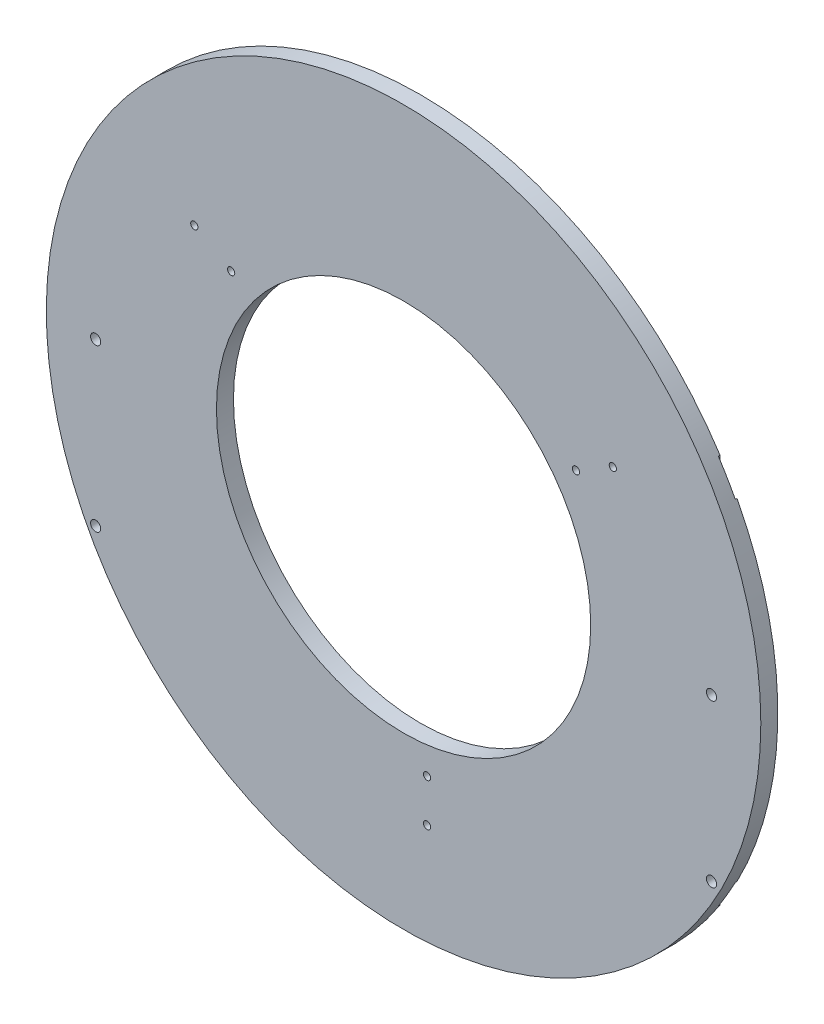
ISO-10303-21;
HEADER;
FILE_DESCRIPTION(('STEP AP214'),'2;1');
FILE_NAME('part.step','',(''),(''),'','','');
FILE_SCHEMA(('AUTOMOTIVE_DESIGN { 1 0 10303 214 1 1 1 1 }'));
ENDSEC;
DATA;
#1=APPLICATION_CONTEXT('core data for automotive mechanical design processes');
#2=APPLICATION_PROTOCOL_DEFINITION('international standard','automotive_design',2000,#1);
#3=PRODUCT_CONTEXT('',#1,'mechanical');
#4=PRODUCT('Part','Part','',(#3));
#5=PRODUCT_RELATED_PRODUCT_CATEGORY('part','',(#4));
#6=PRODUCT_DEFINITION_FORMATION('','',#4);
#7=PRODUCT_DEFINITION_CONTEXT('part definition',#1,'design');
#8=PRODUCT_DEFINITION('design','',#6,#7);
#9=PRODUCT_DEFINITION_SHAPE('','',#8);
#10=(LENGTH_UNIT() NAMED_UNIT(*) SI_UNIT(.MILLI.,.METRE.));
#11=(NAMED_UNIT(*) PLANE_ANGLE_UNIT() SI_UNIT($,.RADIAN.));
#12=(NAMED_UNIT(*) SI_UNIT($,.STERADIAN.) SOLID_ANGLE_UNIT());
#13=UNCERTAINTY_MEASURE_WITH_UNIT(LENGTH_MEASURE(1.E-05),#10,'distance_accuracy_value','');
#14=(GEOMETRIC_REPRESENTATION_CONTEXT(3) GLOBAL_UNCERTAINTY_ASSIGNED_CONTEXT((#13)) GLOBAL_UNIT_ASSIGNED_CONTEXT((#10,
#11,#12)) REPRESENTATION_CONTEXT('',''));
#15=CARTESIAN_POINT('',(0.,0.,0.));
#16=DIRECTION('',(0.,0.,1.));
#17=DIRECTION('',(1.,0.,0.));
#18=AXIS2_PLACEMENT_3D('',#15,#16,#17);
#19=CARTESIAN_POINT('',(0.,0.,0.));
#20=DIRECTION('',(0.,0.,1.));
#21=DIRECTION('',(1.,0.,0.));
#22=AXIS2_PLACEMENT_3D('',#19,#20,#21);
#23=PLANE('',#22);
#24=CARTESIAN_POINT('',(0.,0.,0.));
#25=DIRECTION('',(0.,0.,1.));
#26=DIRECTION('',(1.,0.,0.));
#27=AXIS2_PLACEMENT_3D('',#24,#25,#26);
#28=CIRCLE('',#27,133.35);
#29=CARTESIAN_POINT('',(-118.11,61.9051726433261,0.));
#30=VERTEX_POINT('',#29);
#31=CARTESIAN_POINT('',(-118.11,-61.9051726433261,0.));
#32=VERTEX_POINT('',#31);
#33=EDGE_CURVE('E232',#30,#32,#28,.T.);
#34=ORIENTED_EDGE('',*,*,#33,.F.);
#35=DIRECTION('',(0.,1.,0.));
#36=VECTOR('',#35,1.);
#37=CARTESIAN_POINT('',(-118.11,72.745617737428,0.));
#38=LINE('',#37,#36);
#39=EDGE_CURVE('E117',#32,#30,#38,.T.);
#40=ORIENTED_EDGE('',*,*,#39,.F.);
#41=EDGE_LOOP('',(#34,#40));
#42=FACE_BOUND('',#41,.T.);
#43=ADVANCED_FACE('F35',(#42),#23,.F.);
#44=CARTESIAN_POINT('',(-114.935,-60.325,6.35));
#45=DIRECTION('',(0.,0.,1.));
#46=DIRECTION('',(1.,0.,0.));
#47=AXIS2_PLACEMENT_3D('',#44,#45,#46);
#48=CYLINDRICAL_SURFACE('',#47,1.89864999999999);
#49=CARTESIAN_POINT('',(-114.935,-60.325,6.35));
#50=DIRECTION('',(0.,0.,1.));
#51=DIRECTION('',(1.,0.,0.));
#52=AXIS2_PLACEMENT_3D('',#49,#50,#51);
#53=CIRCLE('',#52,1.89864999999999);
#54=CARTESIAN_POINT('',(-113.03635,-60.325,6.35));
#55=VERTEX_POINT('',#54);
#56=EDGE_CURVE('E158',#55,#55,#53,.T.);
#57=ORIENTED_EDGE('',*,*,#56,.T.);
#58=EDGE_LOOP('',(#57));
#59=FACE_BOUND('',#58,.T.);
#60=CARTESIAN_POINT('',(-114.935,-60.325,0.635));
#61=DIRECTION('',(0.,0.,-1.));
#62=DIRECTION('',(-1.,0.,0.));
#63=AXIS2_PLACEMENT_3D('',#60,#61,#62);
#64=CIRCLE('',#63,1.89864999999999);
#65=CARTESIAN_POINT('',(-116.83365,-60.325,0.635));
#66=VERTEX_POINT('',#65);
#67=EDGE_CURVE('E130',#66,#66,#64,.F.);
#68=ORIENTED_EDGE('',*,*,#67,.F.);
#69=EDGE_LOOP('',(#68));
#70=FACE_BOUND('',#69,.T.);
#71=ADVANCED_FACE('F264',(#59,#70),#48,.F.);
#72=CARTESIAN_POINT('',(-114.935,0.,6.35));
#73=DIRECTION('',(0.,0.,1.));
#74=DIRECTION('',(1.,0.,0.));
#75=AXIS2_PLACEMENT_3D('',#72,#73,#74);
#76=CYLINDRICAL_SURFACE('',#75,1.89864999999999);
#77=CARTESIAN_POINT('',(-114.935,0.,6.35));
#78=DIRECTION('',(0.,0.,1.));
#79=DIRECTION('',(1.,0.,0.));
#80=AXIS2_PLACEMENT_3D('',#77,#78,#79);
#81=CIRCLE('',#80,1.89864999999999);
#82=CARTESIAN_POINT('',(-113.03635,0.,6.35));
#83=VERTEX_POINT('',#82);
#84=EDGE_CURVE('E152',#83,#83,#81,.T.);
#85=ORIENTED_EDGE('',*,*,#84,.T.);
#86=EDGE_LOOP('',(#85));
#87=FACE_BOUND('',#86,.T.);
#88=CARTESIAN_POINT('',(-114.935,0.,0.635));
#89=DIRECTION('',(0.,0.,-1.));
#90=DIRECTION('',(-1.,0.,0.));
#91=AXIS2_PLACEMENT_3D('',#88,#89,#90);
#92=CIRCLE('',#91,1.89864999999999);
#93=CARTESIAN_POINT('',(-116.83365,0.,0.635));
#94=VERTEX_POINT('',#93);
#95=EDGE_CURVE('E125',#94,#94,#92,.F.);
#96=ORIENTED_EDGE('',*,*,#95,.F.);
#97=EDGE_LOOP('',(#96));
#98=FACE_BOUND('',#97,.T.);
#99=ADVANCED_FACE('F268',(#87,#98),#76,.F.);
#100=CARTESIAN_POINT('',(118.11,-61.9051726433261,0.));
#101=VERTEX_POINT('',#100);
#102=CARTESIAN_POINT('',(118.11,61.9051726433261,0.));
#103=VERTEX_POINT('',#102);
#104=EDGE_CURVE('E168',#101,#103,#28,.T.);
#105=ORIENTED_EDGE('',*,*,#104,.F.);
#106=DIRECTION('',(0.,-1.,0.));
#107=VECTOR('',#106,1.);
#108=CARTESIAN_POINT('',(118.11,72.745617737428,0.));
#109=LINE('',#108,#107);
#110=EDGE_CURVE('E107',#103,#101,#109,.T.);
#111=ORIENTED_EDGE('',*,*,#110,.F.);
#112=EDGE_LOOP('',(#105,#111));
#113=FACE_BOUND('',#112,.T.);
#114=ADVANCED_FACE('F246',(#113),#23,.F.);
#115=CARTESIAN_POINT('',(114.935,-60.325,6.35));
#116=DIRECTION('',(0.,0.,1.));
#117=DIRECTION('',(1.,0.,0.));
#118=AXIS2_PLACEMENT_3D('',#115,#116,#117);
#119=CYLINDRICAL_SURFACE('',#118,1.89864999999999);
#120=CARTESIAN_POINT('',(114.935,-60.325,6.35));
#121=DIRECTION('',(0.,0.,1.));
#122=DIRECTION('',(1.,0.,0.));
#123=AXIS2_PLACEMENT_3D('',#120,#121,#122);
#124=CIRCLE('',#123,1.89864999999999);
#125=CARTESIAN_POINT('',(116.83365,-60.325,6.35));
#126=VERTEX_POINT('',#125);
#127=EDGE_CURVE('E161',#126,#126,#124,.T.);
#128=ORIENTED_EDGE('',*,*,#127,.T.);
#129=EDGE_LOOP('',(#128));
#130=FACE_BOUND('',#129,.T.);
#131=CARTESIAN_POINT('',(114.935,-60.325,0.635));
#132=DIRECTION('',(0.,0.,-1.));
#133=DIRECTION('',(-1.,0.,0.));
#134=AXIS2_PLACEMENT_3D('',#131,#132,#133);
#135=CIRCLE('',#134,1.89864999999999);
#136=CARTESIAN_POINT('',(113.03635,-60.325,0.635));
#137=VERTEX_POINT('',#136);
#138=EDGE_CURVE('E146',#137,#137,#135,.F.);
#139=ORIENTED_EDGE('',*,*,#138,.F.);
#140=EDGE_LOOP('',(#139));
#141=FACE_BOUND('',#140,.T.);
#142=ADVANCED_FACE('F272',(#130,#141),#119,.F.);
#143=CARTESIAN_POINT('',(114.935,0.,6.35));
#144=DIRECTION('',(0.,0.,1.));
#145=DIRECTION('',(1.,0.,0.));
#146=AXIS2_PLACEMENT_3D('',#143,#144,#145);
#147=CYLINDRICAL_SURFACE('',#146,1.89864999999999);
#148=CARTESIAN_POINT('',(114.935,0.,6.35));
#149=DIRECTION('',(0.,0.,1.));
#150=DIRECTION('',(1.,0.,0.));
#151=AXIS2_PLACEMENT_3D('',#148,#149,#150);
#152=CIRCLE('',#151,1.89864999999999);
#153=CARTESIAN_POINT('',(116.83365,0.,6.35));
#154=VERTEX_POINT('',#153);
#155=EDGE_CURVE('E155',#154,#154,#152,.T.);
#156=ORIENTED_EDGE('',*,*,#155,.T.);
#157=EDGE_LOOP('',(#156));
#158=FACE_BOUND('',#157,.T.);
#159=CARTESIAN_POINT('',(114.935,0.,0.635));
#160=DIRECTION('',(0.,0.,-1.));
#161=DIRECTION('',(-1.,0.,0.));
#162=AXIS2_PLACEMENT_3D('',#159,#160,#161);
#163=CIRCLE('',#162,1.89864999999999);
#164=CARTESIAN_POINT('',(113.03635,0.,0.635));
#165=VERTEX_POINT('',#164);
#166=EDGE_CURVE('E143',#165,#165,#163,.F.);
#167=ORIENTED_EDGE('',*,*,#166,.F.);
#168=EDGE_LOOP('',(#167));
#169=FACE_BOUND('',#168,.T.);
#170=ADVANCED_FACE('F278',(#158,#169),#147,.F.);
#171=CARTESIAN_POINT('',(0.,0.,6.35));
#172=DIRECTION('',(0.,0.,1.));
#173=DIRECTION('',(1.,0.,0.));
#174=AXIS2_PLACEMENT_3D('',#171,#172,#173);
#175=PLANE('',#174);
#176=CARTESIAN_POINT('',(8.763,-79.375,6.35));
#177=DIRECTION('',(0.,0.,1.));
#178=DIRECTION('',(1.,0.,0.));
#179=AXIS2_PLACEMENT_3D('',#176,#177,#178);
#180=CIRCLE('',#179,1.35254999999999);
#181=CARTESIAN_POINT('',(10.11555,-79.375,6.35));
#182=VERTEX_POINT('',#181);
#183=EDGE_CURVE('E217',#182,#182,#180,.T.);
#184=ORIENTED_EDGE('',*,*,#183,.F.);
#185=EDGE_LOOP('',(#184));
#186=FACE_BOUND('',#185,.T.);
#187=CARTESIAN_POINT('',(8.76300000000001,-95.25,6.35));
#188=DIRECTION('',(0.,0.,1.));
#189=DIRECTION('',(1.,0.,0.));
#190=AXIS2_PLACEMENT_3D('',#187,#188,#189);
#191=CIRCLE('',#190,1.35254999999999);
#192=CARTESIAN_POINT('',(10.11555,-95.25,6.35));
#193=VERTEX_POINT('',#192);
#194=EDGE_CURVE('E207',#193,#193,#191,.T.);
#195=ORIENTED_EDGE('',*,*,#194,.F.);
#196=EDGE_LOOP('',(#195));
#197=FACE_BOUND('',#196,.T.);
#198=CARTESIAN_POINT('',(64.3592664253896,47.2764806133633,6.35));
#199=DIRECTION('',(0.,0.,1.));
#200=DIRECTION('',(1.,0.,0.));
#201=AXIS2_PLACEMENT_3D('',#198,#199,#200);
#202=CIRCLE('',#201,1.35254999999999);
#203=CARTESIAN_POINT('',(65.7118164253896,47.2764806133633,6.35));
#204=VERTEX_POINT('',#203);
#205=EDGE_CURVE('E204',#204,#204,#202,.T.);
#206=ORIENTED_EDGE('',*,*,#205,.F.);
#207=EDGE_LOOP('',(#206));
#208=FACE_BOUND('',#207,.T.);
#209=CARTESIAN_POINT('',(78.1074197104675,55.2139806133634,6.35));
#210=DIRECTION('',(0.,0.,1.));
#211=DIRECTION('',(1.,0.,0.));
#212=AXIS2_PLACEMENT_3D('',#209,#210,#211);
#213=CIRCLE('',#212,1.35254999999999);
#214=CARTESIAN_POINT('',(79.4599697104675,55.2139806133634,6.35));
#215=VERTEX_POINT('',#214);
#216=EDGE_CURVE('E201',#215,#215,#213,.T.);
#217=ORIENTED_EDGE('',*,*,#216,.F.);
#218=EDGE_LOOP('',(#217));
#219=FACE_BOUND('',#218,.T.);
#220=CARTESIAN_POINT('',(-78.1074197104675,55.2139806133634,6.35));
#221=DIRECTION('',(0.,0.,1.));
#222=DIRECTION('',(1.,0.,0.));
#223=AXIS2_PLACEMENT_3D('',#220,#221,#222);
#224=CIRCLE('',#223,1.35254999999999);
#225=CARTESIAN_POINT('',(-76.7548697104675,55.2139806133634,6.35));
#226=VERTEX_POINT('',#225);
#227=EDGE_CURVE('E197',#226,#226,#224,.T.);
#228=ORIENTED_EDGE('',*,*,#227,.F.);
#229=EDGE_LOOP('',(#228));
#230=FACE_BOUND('',#229,.T.);
#231=CARTESIAN_POINT('',(-64.3592664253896,47.2764806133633,6.35));
#232=DIRECTION('',(0.,0.,1.));
#233=DIRECTION('',(1.,0.,0.));
#234=AXIS2_PLACEMENT_3D('',#231,#232,#233);
#235=CIRCLE('',#234,1.35254999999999);
#236=CARTESIAN_POINT('',(-63.0067164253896,47.2764806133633,6.35));
#237=VERTEX_POINT('',#236);
#238=EDGE_CURVE('E193',#237,#237,#235,.T.);
#239=ORIENTED_EDGE('',*,*,#238,.F.);
#240=EDGE_LOOP('',(#239));
#241=FACE_BOUND('',#240,.T.);
#242=ORIENTED_EDGE('',*,*,#84,.F.);
#243=EDGE_LOOP('',(#242));
#244=FACE_BOUND('',#243,.T.);
#245=ORIENTED_EDGE('',*,*,#155,.F.);
#246=EDGE_LOOP('',(#245));
#247=FACE_BOUND('',#246,.T.);
#248=ORIENTED_EDGE('',*,*,#56,.F.);
#249=EDGE_LOOP('',(#248));
#250=FACE_BOUND('',#249,.T.);
#251=ORIENTED_EDGE('',*,*,#127,.F.);
#252=EDGE_LOOP('',(#251));
#253=FACE_BOUND('',#252,.T.);
#254=CARTESIAN_POINT('',(0.,0.,6.35));
#255=DIRECTION('',(0.,0.,1.));
#256=DIRECTION('',(1.,0.,0.));
#257=AXIS2_PLACEMENT_3D('',#254,#255,#256);
#258=CIRCLE('',#257,133.35);
#259=CARTESIAN_POINT('',(133.35,0.,6.35));
#260=VERTEX_POINT('',#259);
#261=EDGE_CURVE('E171',#260,#260,#258,.T.);
#262=ORIENTED_EDGE('',*,*,#261,.T.);
#263=EDGE_LOOP('',(#262));
#264=FACE_BOUND('',#263,.T.);
#265=CARTESIAN_POINT('',(0.,0.,6.35));
#266=DIRECTION('',(0.,0.,1.));
#267=DIRECTION('',(1.,0.,0.));
#268=AXIS2_PLACEMENT_3D('',#265,#266,#267);
#269=CIRCLE('',#268,69.85);
#270=CARTESIAN_POINT('',(69.85,0.,6.35));
#271=VERTEX_POINT('',#270);
#272=EDGE_CURVE('E165',#271,#271,#269,.T.);
#273=ORIENTED_EDGE('',*,*,#272,.F.);
#274=EDGE_LOOP('',(#273));
#275=FACE_BOUND('',#274,.T.);
#276=ADVANCED_FACE('F244',(#186,#197,#208,#219,#230,#241,#244,#247,#250,#253,#264,#275),#175,.T.);
#277=CARTESIAN_POINT('',(8.763,-79.375,0.));
#278=DIRECTION('',(0.,0.,1.));
#279=DIRECTION('',(1.,0.,0.));
#280=AXIS2_PLACEMENT_3D('',#277,#278,#279);
#281=CIRCLE('',#280,1.35254999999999);
#282=CARTESIAN_POINT('',(10.11555,-79.375,0.));
#283=VERTEX_POINT('',#282);
#284=EDGE_CURVE('E39',#283,#283,#281,.T.);
#285=ORIENTED_EDGE('',*,*,#284,.T.);
#286=EDGE_LOOP('',(#285));
#287=FACE_BOUND('',#286,.T.);
#288=CARTESIAN_POINT('',(8.76300000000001,-95.25,0.));
#289=DIRECTION('',(0.,0.,1.));
#290=DIRECTION('',(1.,0.,0.));
#291=AXIS2_PLACEMENT_3D('',#288,#289,#290);
#292=CIRCLE('',#291,1.35254999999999);
#293=CARTESIAN_POINT('',(10.11555,-95.25,0.));
#294=VERTEX_POINT('',#293);
#295=EDGE_CURVE('E205',#294,#294,#292,.T.);
#296=ORIENTED_EDGE('',*,*,#295,.T.);
#297=EDGE_LOOP('',(#296));
#298=FACE_BOUND('',#297,.T.);
#299=CARTESIAN_POINT('',(64.3592664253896,47.2764806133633,0.));
#300=DIRECTION('',(0.,0.,1.));
#301=DIRECTION('',(1.,0.,0.));
#302=AXIS2_PLACEMENT_3D('',#299,#300,#301);
#303=CIRCLE('',#302,1.35254999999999);
#304=CARTESIAN_POINT('',(65.7118164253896,47.2764806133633,0.));
#305=VERTEX_POINT('',#304);
#306=EDGE_CURVE('E202',#305,#305,#303,.T.);
#307=ORIENTED_EDGE('',*,*,#306,.T.);
#308=EDGE_LOOP('',(#307));
#309=FACE_BOUND('',#308,.T.);
#310=CARTESIAN_POINT('',(78.1074197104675,55.2139806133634,0.));
#311=DIRECTION('',(0.,0.,1.));
#312=DIRECTION('',(1.,0.,0.));
#313=AXIS2_PLACEMENT_3D('',#310,#311,#312);
#314=CIRCLE('',#313,1.35254999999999);
#315=CARTESIAN_POINT('',(79.4599697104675,55.2139806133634,0.));
#316=VERTEX_POINT('',#315);
#317=EDGE_CURVE('E198',#316,#316,#314,.T.);
#318=ORIENTED_EDGE('',*,*,#317,.T.);
#319=EDGE_LOOP('',(#318));
#320=FACE_BOUND('',#319,.T.);
#321=CARTESIAN_POINT('',(-78.1074197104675,55.2139806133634,0.));
#322=DIRECTION('',(0.,0.,1.));
#323=DIRECTION('',(1.,0.,0.));
#324=AXIS2_PLACEMENT_3D('',#321,#322,#323);
#325=CIRCLE('',#324,1.35254999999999);
#326=CARTESIAN_POINT('',(-76.7548697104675,55.2139806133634,0.));
#327=VERTEX_POINT('',#326);
#328=EDGE_CURVE('E194',#327,#327,#325,.T.);
#329=ORIENTED_EDGE('',*,*,#328,.T.);
#330=EDGE_LOOP('',(#329));
#331=FACE_BOUND('',#330,.T.);
#332=CARTESIAN_POINT('',(-64.3592664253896,47.2764806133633,0.));
#333=DIRECTION('',(0.,0.,1.));
#334=DIRECTION('',(1.,0.,0.));
#335=AXIS2_PLACEMENT_3D('',#332,#333,#334);
#336=CIRCLE('',#335,1.35254999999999);
#337=CARTESIAN_POINT('',(-63.0067164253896,47.2764806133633,0.));
#338=VERTEX_POINT('',#337);
#339=EDGE_CURVE('E189',#338,#338,#336,.T.);
#340=ORIENTED_EDGE('',*,*,#339,.T.);
#341=EDGE_LOOP('',(#340));
#342=FACE_BOUND('',#341,.T.);
#343=CARTESIAN_POINT('',(-111.76,-72.745617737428,0.));
#344=VERTEX_POINT('',#343);
#345=CARTESIAN_POINT('',(111.76,-72.745617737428,0.));
#346=VERTEX_POINT('',#345);
#347=EDGE_CURVE('E177',#344,#346,#28,.T.);
#348=ORIENTED_EDGE('',*,*,#347,.F.);
#349=DIRECTION('',(0.,-1.,0.));
#350=VECTOR('',#349,1.);
#351=CARTESIAN_POINT('',(-111.76,72.745617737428,0.));
#352=LINE('',#351,#350);
#353=CARTESIAN_POINT('',(-111.76,72.745617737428,0.));
#354=VERTEX_POINT('',#353);
#355=EDGE_CURVE('E192',#354,#344,#352,.T.);
#356=ORIENTED_EDGE('',*,*,#355,.F.);
#357=CARTESIAN_POINT('',(111.76,72.745617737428,0.));
#358=VERTEX_POINT('',#357);
#359=EDGE_CURVE('E123',#358,#354,#28,.T.);
#360=ORIENTED_EDGE('',*,*,#359,.F.);
#361=DIRECTION('',(0.,1.,0.));
#362=VECTOR('',#361,1.);
#363=CARTESIAN_POINT('',(111.76,72.745617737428,0.));
#364=LINE('',#363,#362);
#365=EDGE_CURVE('E135',#346,#358,#364,.T.);
#366=ORIENTED_EDGE('',*,*,#365,.F.);
#367=EDGE_LOOP('',(#348,#356,#360,#366));
#368=FACE_BOUND('',#367,.T.);
#369=CARTESIAN_POINT('',(0.,0.,0.));
#370=DIRECTION('',(0.,0.,1.));
#371=DIRECTION('',(1.,0.,0.));
#372=AXIS2_PLACEMENT_3D('',#369,#370,#371);
#373=CIRCLE('',#372,69.85);
#374=CARTESIAN_POINT('',(69.85,0.,0.));
#375=VERTEX_POINT('',#374);
#376=EDGE_CURVE('E164',#375,#375,#373,.T.);
#377=ORIENTED_EDGE('',*,*,#376,.T.);
#378=EDGE_LOOP('',(#377));
#379=FACE_BOUND('',#378,.T.);
#380=ADVANCED_FACE('F241',(#287,#298,#309,#320,#331,#342,#368,#379),#23,.F.);
#381=CARTESIAN_POINT('',(0.,0.,6.35));
#382=DIRECTION('',(0.,0.,-1.));
#383=DIRECTION('',(-1.,0.,0.));
#384=AXIS2_PLACEMENT_3D('',#381,#382,#383);
#385=CYLINDRICAL_SURFACE('',#384,133.35);
#386=CARTESIAN_POINT('',(0.,0.,0.635));
#387=DIRECTION('',(0.,0.,-1.));
#388=DIRECTION('',(-1.,0.,0.));
#389=AXIS2_PLACEMENT_3D('',#386,#387,#388);
#390=CIRCLE('',#389,133.35);
#391=CARTESIAN_POINT('',(-118.11,61.9051726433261,0.635));
#392=VERTEX_POINT('',#391);
#393=CARTESIAN_POINT('',(-111.76,72.745617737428,0.635));
#394=VERTEX_POINT('',#393);
#395=EDGE_CURVE('E101',#392,#394,#390,.T.);
#396=ORIENTED_EDGE('',*,*,#395,.F.);
#397=DIRECTION('',(0.,0.,-1.));
#398=VECTOR('',#397,1.);
#399=CARTESIAN_POINT('',(-118.11,61.9051726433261,6.35));
#400=LINE('',#399,#398);
#401=EDGE_CURVE('E11',#392,#30,#400,.T.);
#402=ORIENTED_EDGE('',*,*,#401,.T.);
#403=ORIENTED_EDGE('',*,*,#33,.T.);
#404=DIRECTION('',(0.,0.,-1.));
#405=VECTOR('',#404,1.);
#406=CARTESIAN_POINT('',(-118.11,-61.9051726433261,6.35));
#407=LINE('',#406,#405);
#408=CARTESIAN_POINT('',(-118.11,-61.9051726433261,0.635));
#409=VERTEX_POINT('',#408);
#410=EDGE_CURVE('E44',#32,#409,#407,.F.);
#411=ORIENTED_EDGE('',*,*,#410,.T.);
#412=CARTESIAN_POINT('',(-111.76,-72.745617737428,0.635));
#413=VERTEX_POINT('',#412);
#414=EDGE_CURVE('E108',#413,#409,#390,.T.);
#415=ORIENTED_EDGE('',*,*,#414,.F.);
#416=DIRECTION('',(0.,0.,-1.));
#417=VECTOR('',#416,1.);
#418=CARTESIAN_POINT('',(-111.76,-72.745617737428,0.635));
#419=LINE('',#418,#417);
#420=EDGE_CURVE('E115',#413,#344,#419,.T.);
#421=ORIENTED_EDGE('',*,*,#420,.T.);
#422=ORIENTED_EDGE('',*,*,#347,.T.);
#423=DIRECTION('',(0.,0.,-1.));
#424=VECTOR('',#423,1.);
#425=CARTESIAN_POINT('',(111.76,-72.745617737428,0.635));
#426=LINE('',#425,#424);
#427=CARTESIAN_POINT('',(111.76,-72.745617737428,0.635));
#428=VERTEX_POINT('',#427);
#429=EDGE_CURVE('E138',#428,#346,#426,.T.);
#430=ORIENTED_EDGE('',*,*,#429,.F.);
#431=CARTESIAN_POINT('',(0.,0.,0.635));
#432=DIRECTION('',(0.,0.,-1.));
#433=DIRECTION('',(-1.,0.,0.));
#434=AXIS2_PLACEMENT_3D('',#431,#432,#433);
#435=CIRCLE('',#434,133.35);
#436=CARTESIAN_POINT('',(118.11,-61.9051726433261,0.635));
#437=VERTEX_POINT('',#436);
#438=EDGE_CURVE('E149',#437,#428,#435,.T.);
#439=ORIENTED_EDGE('',*,*,#438,.F.);
#440=DIRECTION('',(0.,0.,-1.));
#441=VECTOR('',#440,1.);
#442=CARTESIAN_POINT('',(118.11,-61.9051726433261,6.35));
#443=LINE('',#442,#441);
#444=EDGE_CURVE('E174',#437,#101,#443,.T.);
#445=ORIENTED_EDGE('',*,*,#444,.T.);
#446=ORIENTED_EDGE('',*,*,#104,.T.);
#447=DIRECTION('',(0.,0.,-1.));
#448=VECTOR('',#447,1.);
#449=CARTESIAN_POINT('',(118.11,61.9051726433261,6.35));
#450=LINE('',#449,#448);
#451=CARTESIAN_POINT('',(118.11,61.9051726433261,0.635));
#452=VERTEX_POINT('',#451);
#453=EDGE_CURVE('E182',#103,#452,#450,.F.);
#454=ORIENTED_EDGE('',*,*,#453,.T.);
#455=CARTESIAN_POINT('',(111.76,72.745617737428,0.635));
#456=VERTEX_POINT('',#455);
#457=EDGE_CURVE('E151',#456,#452,#435,.T.);
#458=ORIENTED_EDGE('',*,*,#457,.F.);
#459=DIRECTION('',(0.,0.,-1.));
#460=VECTOR('',#459,1.);
#461=CARTESIAN_POINT('',(111.76,72.745617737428,0.635));
#462=LINE('',#461,#460);
#463=EDGE_CURVE('E141',#456,#358,#462,.T.);
#464=ORIENTED_EDGE('',*,*,#463,.T.);
#465=ORIENTED_EDGE('',*,*,#359,.T.);
#466=DIRECTION('',(0.,0.,-1.));
#467=VECTOR('',#466,1.);
#468=CARTESIAN_POINT('',(-111.76,72.745617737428,0.635));
#469=LINE('',#468,#467);
#470=EDGE_CURVE('E112',#394,#354,#469,.T.);
#471=ORIENTED_EDGE('',*,*,#470,.F.);
#472=EDGE_LOOP('',(#396,#402,#403,#411,#415,#421,#422,#430,#439,#445,#446,#454,#458,#464,#465,#471));
#473=FACE_BOUND('',#472,.T.);
#474=ORIENTED_EDGE('',*,*,#261,.F.);
#475=EDGE_LOOP('',(#474));
#476=FACE_BOUND('',#475,.T.);
#477=ADVANCED_FACE('F37',(#473,#476),#385,.T.);
#478=CARTESIAN_POINT('',(0.,0.,6.35));
#479=DIRECTION('',(0.,0.,-1.));
#480=DIRECTION('',(-1.,0.,0.));
#481=AXIS2_PLACEMENT_3D('',#478,#479,#480);
#482=CYLINDRICAL_SURFACE('',#481,69.85);
#483=ORIENTED_EDGE('',*,*,#272,.T.);
#484=EDGE_LOOP('',(#483));
#485=FACE_BOUND('',#484,.T.);
#486=ORIENTED_EDGE('',*,*,#376,.F.);
#487=EDGE_LOOP('',(#486));
#488=FACE_BOUND('',#487,.T.);
#489=ADVANCED_FACE('F249',(#485,#488),#482,.F.);
#490=CARTESIAN_POINT('',(118.11,72.745617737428,0.635));
#491=DIRECTION('',(1.,0.,0.));
#492=DIRECTION('',(0.,0.,-1.));
#493=AXIS2_PLACEMENT_3D('',#490,#491,#492);
#494=PLANE('',#493);
#495=DIRECTION('',(0.,-1.,0.));
#496=VECTOR('',#495,1.);
#497=CARTESIAN_POINT('',(118.11,72.745617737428,0.635));
#498=LINE('',#497,#496);
#499=EDGE_CURVE('E60',#452,#437,#498,.T.);
#500=ORIENTED_EDGE('',*,*,#499,.F.);
#501=ORIENTED_EDGE('',*,*,#453,.F.);
#502=ORIENTED_EDGE('',*,*,#110,.T.);
#503=ORIENTED_EDGE('',*,*,#444,.F.);
#504=EDGE_LOOP('',(#500,#501,#502,#503));
#505=FACE_BOUND('',#504,.T.);
#506=ADVANCED_FACE('F251',(#505),#494,.F.);
#507=CARTESIAN_POINT('',(0.,0.,0.635));
#508=DIRECTION('',(0.,0.,-1.));
#509=DIRECTION('',(-1.,0.,0.));
#510=AXIS2_PLACEMENT_3D('',#507,#508,#509);
#511=PLANE('',#510);
#512=ORIENTED_EDGE('',*,*,#166,.T.);
#513=EDGE_LOOP('',(#512));
#514=FACE_BOUND('',#513,.T.);
#515=ORIENTED_EDGE('',*,*,#138,.T.);
#516=EDGE_LOOP('',(#515));
#517=FACE_BOUND('',#516,.T.);
#518=ORIENTED_EDGE('',*,*,#457,.T.);
#519=ORIENTED_EDGE('',*,*,#499,.T.);
#520=ORIENTED_EDGE('',*,*,#438,.T.);
#521=DIRECTION('',(0.,1.,0.));
#522=VECTOR('',#521,1.);
#523=CARTESIAN_POINT('',(111.76,72.745617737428,0.635));
#524=LINE('',#523,#522);
#525=EDGE_CURVE('E134',#428,#456,#524,.T.);
#526=ORIENTED_EDGE('',*,*,#525,.T.);
#527=EDGE_LOOP('',(#518,#519,#520,#526));
#528=FACE_BOUND('',#527,.T.);
#529=ADVANCED_FACE('F258',(#514,#517,#528),#511,.T.);
#530=CARTESIAN_POINT('',(111.76,72.745617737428,0.635));
#531=DIRECTION('',(-1.,0.,0.));
#532=DIRECTION('',(0.,0.,1.));
#533=AXIS2_PLACEMENT_3D('',#530,#531,#532);
#534=PLANE('',#533);
#535=ORIENTED_EDGE('',*,*,#365,.T.);
#536=ORIENTED_EDGE('',*,*,#463,.F.);
#537=ORIENTED_EDGE('',*,*,#525,.F.);
#538=ORIENTED_EDGE('',*,*,#429,.T.);
#539=EDGE_LOOP('',(#535,#536,#537,#538));
#540=FACE_BOUND('',#539,.T.);
#541=ADVANCED_FACE('F240',(#540),#534,.F.);
#542=CARTESIAN_POINT('',(-118.11,72.745617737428,0.635));
#543=DIRECTION('',(-1.,0.,0.));
#544=DIRECTION('',(0.,0.,1.));
#545=AXIS2_PLACEMENT_3D('',#542,#543,#544);
#546=PLANE('',#545);
#547=DIRECTION('',(0.,1.,0.));
#548=VECTOR('',#547,1.);
#549=CARTESIAN_POINT('',(-118.11,72.745617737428,0.635));
#550=LINE('',#549,#548);
#551=EDGE_CURVE('E104',#409,#392,#550,.T.);
#552=ORIENTED_EDGE('',*,*,#551,.F.);
#553=ORIENTED_EDGE('',*,*,#410,.F.);
#554=ORIENTED_EDGE('',*,*,#39,.T.);
#555=ORIENTED_EDGE('',*,*,#401,.F.);
#556=EDGE_LOOP('',(#552,#553,#554,#555));
#557=FACE_BOUND('',#556,.T.);
#558=ADVANCED_FACE('F228',(#557),#546,.F.);
#559=CARTESIAN_POINT('',(0.,0.,0.635));
#560=DIRECTION('',(0.,0.,-1.));
#561=DIRECTION('',(-1.,0.,0.));
#562=AXIS2_PLACEMENT_3D('',#559,#560,#561);
#563=PLANE('',#562);
#564=ORIENTED_EDGE('',*,*,#95,.T.);
#565=EDGE_LOOP('',(#564));
#566=FACE_BOUND('',#565,.T.);
#567=ORIENTED_EDGE('',*,*,#67,.T.);
#568=EDGE_LOOP('',(#567));
#569=FACE_BOUND('',#568,.T.);
#570=ORIENTED_EDGE('',*,*,#395,.T.);
#571=DIRECTION('',(0.,-1.,0.));
#572=VECTOR('',#571,1.);
#573=CARTESIAN_POINT('',(-111.76,72.745617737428,0.635));
#574=LINE('',#573,#572);
#575=EDGE_CURVE('E52',#394,#413,#574,.T.);
#576=ORIENTED_EDGE('',*,*,#575,.T.);
#577=ORIENTED_EDGE('',*,*,#414,.T.);
#578=ORIENTED_EDGE('',*,*,#551,.T.);
#579=EDGE_LOOP('',(#570,#576,#577,#578));
#580=FACE_BOUND('',#579,.T.);
#581=ADVANCED_FACE('F102',(#566,#569,#580),#563,.T.);
#582=CARTESIAN_POINT('',(-111.76,72.745617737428,0.635));
#583=DIRECTION('',(1.,0.,0.));
#584=DIRECTION('',(0.,0.,-1.));
#585=AXIS2_PLACEMENT_3D('',#582,#583,#584);
#586=PLANE('',#585);
#587=ORIENTED_EDGE('',*,*,#355,.T.);
#588=ORIENTED_EDGE('',*,*,#420,.F.);
#589=ORIENTED_EDGE('',*,*,#575,.F.);
#590=ORIENTED_EDGE('',*,*,#470,.T.);
#591=EDGE_LOOP('',(#587,#588,#589,#590));
#592=FACE_BOUND('',#591,.T.);
#593=ADVANCED_FACE('F111',(#592),#586,.F.);
#594=CARTESIAN_POINT('',(-64.3592664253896,47.2764806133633,6.35));
#595=DIRECTION('',(0.,0.,1.));
#596=DIRECTION('',(1.,0.,0.));
#597=AXIS2_PLACEMENT_3D('',#594,#595,#596);
#598=CYLINDRICAL_SURFACE('',#597,1.35254999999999);
#599=ORIENTED_EDGE('',*,*,#238,.T.);
#600=EDGE_LOOP('',(#599));
#601=FACE_BOUND('',#600,.T.);
#602=ORIENTED_EDGE('',*,*,#339,.F.);
#603=EDGE_LOOP('',(#602));
#604=FACE_BOUND('',#603,.T.);
#605=ADVANCED_FACE('F327',(#601,#604),#598,.F.);
#606=CARTESIAN_POINT('',(-78.1074197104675,55.2139806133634,6.35));
#607=DIRECTION('',(0.,0.,1.));
#608=DIRECTION('',(1.,0.,0.));
#609=AXIS2_PLACEMENT_3D('',#606,#607,#608);
#610=CYLINDRICAL_SURFACE('',#609,1.35254999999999);
#611=ORIENTED_EDGE('',*,*,#227,.T.);
#612=EDGE_LOOP('',(#611));
#613=FACE_BOUND('',#612,.T.);
#614=ORIENTED_EDGE('',*,*,#328,.F.);
#615=EDGE_LOOP('',(#614));
#616=FACE_BOUND('',#615,.T.);
#617=ADVANCED_FACE('F331',(#613,#616),#610,.F.);
#618=CARTESIAN_POINT('',(78.1074197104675,55.2139806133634,6.35));
#619=DIRECTION('',(0.,0.,1.));
#620=DIRECTION('',(1.,0.,0.));
#621=AXIS2_PLACEMENT_3D('',#618,#619,#620);
#622=CYLINDRICAL_SURFACE('',#621,1.35254999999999);
#623=ORIENTED_EDGE('',*,*,#216,.T.);
#624=EDGE_LOOP('',(#623));
#625=FACE_BOUND('',#624,.T.);
#626=ORIENTED_EDGE('',*,*,#317,.F.);
#627=EDGE_LOOP('',(#626));
#628=FACE_BOUND('',#627,.T.);
#629=ADVANCED_FACE('F335',(#625,#628),#622,.F.);
#630=CARTESIAN_POINT('',(64.3592664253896,47.2764806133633,6.35));
#631=DIRECTION('',(0.,0.,1.));
#632=DIRECTION('',(1.,0.,0.));
#633=AXIS2_PLACEMENT_3D('',#630,#631,#632);
#634=CYLINDRICAL_SURFACE('',#633,1.35254999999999);
#635=ORIENTED_EDGE('',*,*,#205,.T.);
#636=EDGE_LOOP('',(#635));
#637=FACE_BOUND('',#636,.T.);
#638=ORIENTED_EDGE('',*,*,#306,.F.);
#639=EDGE_LOOP('',(#638));
#640=FACE_BOUND('',#639,.T.);
#641=ADVANCED_FACE('F339',(#637,#640),#634,.F.);
#642=CARTESIAN_POINT('',(8.76300000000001,-95.25,6.35));
#643=DIRECTION('',(0.,0.,1.));
#644=DIRECTION('',(1.,0.,0.));
#645=AXIS2_PLACEMENT_3D('',#642,#643,#644);
#646=CYLINDRICAL_SURFACE('',#645,1.35254999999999);
#647=ORIENTED_EDGE('',*,*,#194,.T.);
#648=EDGE_LOOP('',(#647));
#649=FACE_BOUND('',#648,.T.);
#650=ORIENTED_EDGE('',*,*,#295,.F.);
#651=EDGE_LOOP('',(#650));
#652=FACE_BOUND('',#651,.T.);
#653=ADVANCED_FACE('F343',(#649,#652),#646,.F.);
#654=CARTESIAN_POINT('',(8.763,-79.375,6.35));
#655=DIRECTION('',(0.,0.,1.));
#656=DIRECTION('',(1.,0.,0.));
#657=AXIS2_PLACEMENT_3D('',#654,#655,#656);
#658=CYLINDRICAL_SURFACE('',#657,1.35254999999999);
#659=ORIENTED_EDGE('',*,*,#183,.T.);
#660=EDGE_LOOP('',(#659));
#661=FACE_BOUND('',#660,.T.);
#662=ORIENTED_EDGE('',*,*,#284,.F.);
#663=EDGE_LOOP('',(#662));
#664=FACE_BOUND('',#663,.T.);
#665=ADVANCED_FACE('F347',(#661,#664),#658,.F.);
#666=CLOSED_SHELL('',(#43,#71,#99,#114,#142,#170,#276,#380,#477,#489,#506,#529,#541,#558,#581,
#593,#605,#617,#629,#641,#653,#665));
#667=MANIFOLD_SOLID_BREP('B2',#666);
#668=ADVANCED_BREP_SHAPE_REPRESENTATION('',(#18,#667),#14);
#669=SHAPE_DEFINITION_REPRESENTATION(#9,#668);
ENDSEC;
END-ISO-10303-21;
